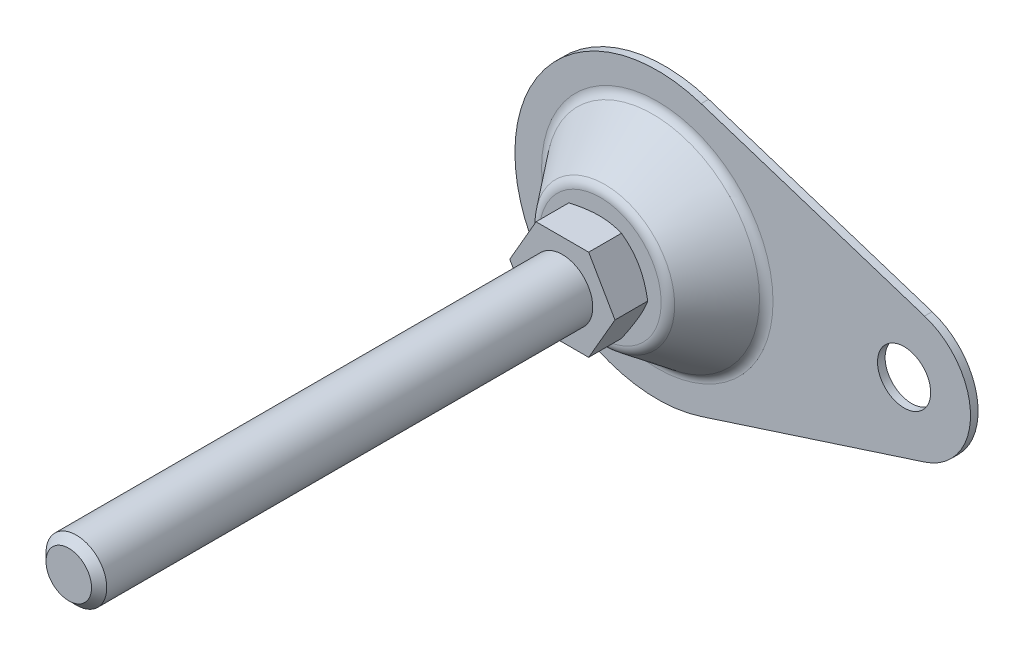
ISO-10303-21;
HEADER;
FILE_DESCRIPTION(('STEP AP214'),'2;1');
FILE_NAME('part.step','',(''),(''),'','','');
FILE_SCHEMA(('AUTOMOTIVE_DESIGN { 1 0 10303 214 1 1 1 1 }'));
ENDSEC;
DATA;
#1=APPLICATION_CONTEXT('core data for automotive mechanical design processes');
#2=APPLICATION_PROTOCOL_DEFINITION('international standard','automotive_design',2000,#1);
#3=PRODUCT_CONTEXT('',#1,'mechanical');
#4=PRODUCT('Part','Part','',(#3));
#5=PRODUCT_RELATED_PRODUCT_CATEGORY('part','',(#4));
#6=PRODUCT_DEFINITION_FORMATION('','',#4);
#7=PRODUCT_DEFINITION_CONTEXT('part definition',#1,'design');
#8=PRODUCT_DEFINITION('design','',#6,#7);
#9=PRODUCT_DEFINITION_SHAPE('','',#8);
#10=(LENGTH_UNIT() NAMED_UNIT(*) SI_UNIT(.MILLI.,.METRE.));
#11=(NAMED_UNIT(*) PLANE_ANGLE_UNIT() SI_UNIT($,.RADIAN.));
#12=(NAMED_UNIT(*) SI_UNIT($,.STERADIAN.) SOLID_ANGLE_UNIT());
#13=UNCERTAINTY_MEASURE_WITH_UNIT(LENGTH_MEASURE(1.E-05),#10,'distance_accuracy_value','');
#14=(GEOMETRIC_REPRESENTATION_CONTEXT(3) GLOBAL_UNCERTAINTY_ASSIGNED_CONTEXT((#13)) GLOBAL_UNIT_ASSIGNED_CONTEXT((#10,
#11,#12)) REPRESENTATION_CONTEXT('',''));
#15=CARTESIAN_POINT('',(0.,0.,0.));
#16=DIRECTION('',(0.,0.,1.));
#17=DIRECTION('',(1.,0.,0.));
#18=AXIS2_PLACEMENT_3D('',#15,#16,#17);
#19=CARTESIAN_POINT('',(65.,0.,2.));
#20=DIRECTION('',(0.,0.,1.));
#21=DIRECTION('',(1.,0.,0.));
#22=AXIS2_PLACEMENT_3D('',#19,#20,#21);
#23=PLANE('',#22);
#24=CARTESIAN_POINT('',(0.,0.,2.));
#25=DIRECTION('',(0.,0.,1.));
#26=DIRECTION('',(1.,0.,0.));
#27=AXIS2_PLACEMENT_3D('',#24,#25,#26);
#28=CIRCLE('',#27,30.4802116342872);
#29=CARTESIAN_POINT('',(30.4802116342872,0.,2.));
#30=VERTEX_POINT('',#29);
#31=EDGE_CURVE('E245',#30,#30,#28,.F.);
#32=ORIENTED_EDGE('',*,*,#31,.T.);
#33=EDGE_LOOP('',(#32));
#34=FACE_BOUND('',#33,.T.);
#35=CARTESIAN_POINT('',(65.,0.,2.));
#36=DIRECTION('',(0.,0.,1.));
#37=DIRECTION('',(1.,0.,0.));
#38=AXIS2_PLACEMENT_3D('',#35,#36,#37);
#39=CIRCLE('',#38,7.);
#40=CARTESIAN_POINT('',(72.,0.,2.));
#41=VERTEX_POINT('',#40);
#42=EDGE_CURVE('E262',#41,#41,#39,.T.);
#43=ORIENTED_EDGE('',*,*,#42,.F.);
#44=EDGE_LOOP('',(#43));
#45=FACE_BOUND('',#44,.T.);
#46=DIRECTION('',(-0.951485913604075,0.307692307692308,0.));
#47=VECTOR('',#46,1.);
#48=CARTESIAN_POINT('',(11.5384615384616,35.6807217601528,2.));
#49=LINE('',#48,#47);
#50=CARTESIAN_POINT('',(70.3846153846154,16.6510034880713,2.));
#51=VERTEX_POINT('',#50);
#52=CARTESIAN_POINT('',(11.5384615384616,35.6807217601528,2.));
#53=VERTEX_POINT('',#52);
#54=EDGE_CURVE('E112',#51,#53,#49,.T.);
#55=ORIENTED_EDGE('',*,*,#54,.T.);
#56=CARTESIAN_POINT('',(0.,0.,2.));
#57=DIRECTION('',(0.,0.,1.));
#58=DIRECTION('',(1.,0.,0.));
#59=AXIS2_PLACEMENT_3D('',#56,#57,#58);
#60=CIRCLE('',#59,37.5);
#61=CARTESIAN_POINT('',(11.5384615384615,-35.6807217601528,2.));
#62=VERTEX_POINT('',#61);
#63=EDGE_CURVE('E114',#53,#62,#60,.T.);
#64=ORIENTED_EDGE('',*,*,#63,.T.);
#65=DIRECTION('',(0.951485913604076,0.307692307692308,0.));
#66=VECTOR('',#65,1.);
#67=CARTESIAN_POINT('',(11.5384615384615,-35.6807217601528,2.));
#68=LINE('',#67,#66);
#69=CARTESIAN_POINT('',(70.3846153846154,-16.6510034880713,2.));
#70=VERTEX_POINT('',#69);
#71=EDGE_CURVE('E97',#62,#70,#68,.T.);
#72=ORIENTED_EDGE('',*,*,#71,.T.);
#73=CARTESIAN_POINT('',(65.,0.,2.));
#74=DIRECTION('',(0.,0.,1.));
#75=DIRECTION('',(1.,0.,0.));
#76=AXIS2_PLACEMENT_3D('',#73,#74,#75);
#77=CIRCLE('',#76,17.5);
#78=EDGE_CURVE('E106',#70,#51,#77,.T.);
#79=ORIENTED_EDGE('',*,*,#78,.T.);
#80=EDGE_LOOP('',(#55,#64,#72,#79));
#81=FACE_BOUND('',#80,.T.);
#82=ADVANCED_FACE('F14',(#34,#45,#81),#23,.T.);
#83=CARTESIAN_POINT('',(65.,0.,0.));
#84=DIRECTION('',(0.,0.,1.));
#85=DIRECTION('',(1.,0.,0.));
#86=AXIS2_PLACEMENT_3D('',#83,#84,#85);
#87=PLANE('',#86);
#88=CARTESIAN_POINT('',(65.,0.,0.));
#89=DIRECTION('',(0.,0.,1.));
#90=DIRECTION('',(1.,0.,0.));
#91=AXIS2_PLACEMENT_3D('',#88,#89,#90);
#92=CIRCLE('',#91,7.);
#93=CARTESIAN_POINT('',(72.,0.,0.));
#94=VERTEX_POINT('',#93);
#95=EDGE_CURVE('E258',#94,#94,#92,.T.);
#96=ORIENTED_EDGE('',*,*,#95,.T.);
#97=EDGE_LOOP('',(#96));
#98=FACE_BOUND('',#97,.T.);
#99=CARTESIAN_POINT('',(0.,0.,0.));
#100=DIRECTION('',(0.,0.,1.));
#101=DIRECTION('',(1.,0.,0.));
#102=AXIS2_PLACEMENT_3D('',#99,#100,#101);
#103=CIRCLE('',#102,37.5);
#104=CARTESIAN_POINT('',(11.5384615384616,35.6807217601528,0.));
#105=VERTEX_POINT('',#104);
#106=CARTESIAN_POINT('',(11.5384615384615,-35.6807217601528,0.));
#107=VERTEX_POINT('',#106);
#108=EDGE_CURVE('E275',#105,#107,#103,.T.);
#109=ORIENTED_EDGE('',*,*,#108,.F.);
#110=DIRECTION('',(-0.951485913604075,0.307692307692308,0.));
#111=VECTOR('',#110,1.);
#112=CARTESIAN_POINT('',(70.3846153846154,16.6510034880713,0.));
#113=LINE('',#112,#111);
#114=CARTESIAN_POINT('',(70.3846153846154,16.6510034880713,0.));
#115=VERTEX_POINT('',#114);
#116=EDGE_CURVE('E9',#115,#105,#113,.T.);
#117=ORIENTED_EDGE('',*,*,#116,.F.);
#118=CARTESIAN_POINT('',(65.,0.,0.));
#119=DIRECTION('',(0.,0.,1.));
#120=DIRECTION('',(1.,0.,0.));
#121=AXIS2_PLACEMENT_3D('',#118,#119,#120);
#122=CIRCLE('',#121,17.5);
#123=CARTESIAN_POINT('',(70.3846153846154,-16.6510034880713,0.));
#124=VERTEX_POINT('',#123);
#125=EDGE_CURVE('E22',#124,#115,#122,.T.);
#126=ORIENTED_EDGE('',*,*,#125,.F.);
#127=DIRECTION('',(0.951485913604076,0.307692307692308,0.));
#128=VECTOR('',#127,1.);
#129=CARTESIAN_POINT('',(70.3846153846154,-16.6510034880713,0.));
#130=LINE('',#129,#128);
#131=EDGE_CURVE('E99',#107,#124,#130,.T.);
#132=ORIENTED_EDGE('',*,*,#131,.F.);
#133=EDGE_LOOP('',(#109,#117,#126,#132));
#134=FACE_BOUND('',#133,.T.);
#135=ADVANCED_FACE('F215',(#98,#134),#87,.F.);
#136=CARTESIAN_POINT('',(0.,0.,17.));
#137=DIRECTION('',(0.,0.,-1.));
#138=DIRECTION('',(-1.,0.,0.));
#139=AXIS2_PLACEMENT_3D('',#136,#137,#138);
#140=PLANE('',#139);
#141=CARTESIAN_POINT('',(0.,0.,17.));
#142=DIRECTION('',(0.,0.,-1.));
#143=DIRECTION('',(-1.,0.,0.));
#144=AXIS2_PLACEMENT_3D('',#141,#142,#143);
#145=CIRCLE('',#144,16.0197883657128);
#146=CARTESIAN_POINT('',(-16.0197883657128,0.,17.));
#147=VERTEX_POINT('',#146);
#148=EDGE_CURVE('E278',#147,#147,#145,.F.);
#149=ORIENTED_EDGE('',*,*,#148,.T.);
#150=EDGE_LOOP('',(#149));
#151=FACE_BOUND('',#150,.T.);
#152=CARTESIAN_POINT('',(0.,0.,17.));
#153=DIRECTION('',(0.,0.,-1.));
#154=DIRECTION('',(-1.,0.,0.));
#155=AXIS2_PLACEMENT_3D('',#152,#153,#154);
#156=CIRCLE('',#155,11.5);
#157=CARTESIAN_POINT('',(-11.5,0.,17.));
#158=VERTEX_POINT('',#157);
#159=EDGE_CURVE('E122',#158,#158,#156,.T.);
#160=ORIENTED_EDGE('',*,*,#159,.T.);
#161=EDGE_LOOP('',(#160));
#162=FACE_BOUND('',#161,.T.);
#163=ADVANCED_FACE('F211',(#151,#162),#140,.F.);
#164=CARTESIAN_POINT('',(0.,0.,5.));
#165=DIRECTION('',(0.,0.,1.));
#166=DIRECTION('',(1.,0.,0.));
#167=AXIS2_PLACEMENT_3D('',#164,#165,#166);
#168=TOROIDAL_SURFACE('',#167,30.4802116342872,3.);
#169=CARTESIAN_POINT('',(0.,0.,3.1747053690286));
#170=DIRECTION('',(0.,0.,1.));
#171=DIRECTION('',(1.,0.,0.));
#172=AXIS2_PLACEMENT_3D('',#169,#170,#171);
#173=CIRCLE('',#172,28.0993925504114);
#174=CARTESIAN_POINT('',(28.0993925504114,0.,3.1747053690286));
#175=VERTEX_POINT('',#174);
#176=EDGE_CURVE('E242',#175,#175,#173,.T.);
#177=ORIENTED_EDGE('',*,*,#176,.F.);
#178=EDGE_LOOP('',(#177));
#179=FACE_BOUND('',#178,.T.);
#180=ORIENTED_EDGE('',*,*,#31,.F.);
#181=EDGE_LOOP('',(#180));
#182=FACE_BOUND('',#181,.T.);
#183=ADVANCED_FACE('F214',(#179,#182),#168,.F.);
#184=CARTESIAN_POINT('',(0.,0.,14.));
#185=DIRECTION('',(0.,0.,-1.));
#186=DIRECTION('',(-1.,0.,0.));
#187=AXIS2_PLACEMENT_3D('',#184,#185,#186);
#188=TOROIDAL_SURFACE('',#187,16.0197883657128,3.);
#189=ORIENTED_EDGE('',*,*,#148,.F.);
#190=EDGE_LOOP('',(#189));
#191=FACE_BOUND('',#190,.T.);
#192=CARTESIAN_POINT('',(0.,0.,15.8252946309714));
#193=DIRECTION('',(0.,0.,1.));
#194=DIRECTION('',(1.,0.,0.));
#195=AXIS2_PLACEMENT_3D('',#192,#193,#194);
#196=CIRCLE('',#195,18.4006074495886);
#197=CARTESIAN_POINT('',(18.4006074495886,0.,15.8252946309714));
#198=VERTEX_POINT('',#197);
#199=EDGE_CURVE('E251',#198,#198,#196,.F.);
#200=ORIENTED_EDGE('',*,*,#199,.F.);
#201=EDGE_LOOP('',(#200));
#202=FACE_BOUND('',#201,.T.);
#203=ADVANCED_FACE('F229',(#191,#202),#188,.T.);
#204=CARTESIAN_POINT('',(0.,0.,2.));
#205=DIRECTION('',(0.,0.,-1.));
#206=DIRECTION('',(-1.,0.,0.));
#207=AXIS2_PLACEMENT_3D('',#204,#205,#206);
#208=CYLINDRICAL_SURFACE('',#207,37.5);
#209=ORIENTED_EDGE('',*,*,#108,.T.);
#210=DIRECTION('',(0.,0.,1.));
#211=VECTOR('',#210,1.);
#212=CARTESIAN_POINT('',(11.5384615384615,-35.6807217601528,-8.));
#213=LINE('',#212,#211);
#214=EDGE_CURVE('E103',#107,#62,#213,.T.);
#215=ORIENTED_EDGE('',*,*,#214,.T.);
#216=ORIENTED_EDGE('',*,*,#63,.F.);
#217=DIRECTION('',(0.,0.,1.));
#218=VECTOR('',#217,1.);
#219=CARTESIAN_POINT('',(11.5384615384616,35.6807217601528,-8.));
#220=LINE('',#219,#218);
#221=EDGE_CURVE('E119',#105,#53,#220,.T.);
#222=ORIENTED_EDGE('',*,*,#221,.F.);
#223=EDGE_LOOP('',(#209,#215,#216,#222));
#224=FACE_BOUND('',#223,.T.);
#225=ADVANCED_FACE('F219',(#224),#208,.T.);
#226=CARTESIAN_POINT('',(65.,0.,2.));
#227=DIRECTION('',(0.,0.,-1.));
#228=DIRECTION('',(-1.,0.,0.));
#229=AXIS2_PLACEMENT_3D('',#226,#227,#228);
#230=CYLINDRICAL_SURFACE('',#229,7.);
#231=ORIENTED_EDGE('',*,*,#42,.T.);
#232=EDGE_LOOP('',(#231));
#233=FACE_BOUND('',#232,.T.);
#234=ORIENTED_EDGE('',*,*,#95,.F.);
#235=EDGE_LOOP('',(#234));
#236=FACE_BOUND('',#235,.T.);
#237=ADVANCED_FACE('F209',(#233,#236),#230,.F.);
#238=CARTESIAN_POINT('',(0.,0.,2.));
#239=DIRECTION('',(0.,0.,-1.));
#240=DIRECTION('',(-1.,0.,0.));
#241=AXIS2_PLACEMENT_3D('',#238,#239,#240);
#242=CONICAL_SURFACE('',#241,29.,0.654082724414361);
#243=ORIENTED_EDGE('',*,*,#176,.T.);
#244=EDGE_LOOP('',(#243));
#245=FACE_BOUND('',#244,.T.);
#246=ORIENTED_EDGE('',*,*,#199,.T.);
#247=EDGE_LOOP('',(#246));
#248=FACE_BOUND('',#247,.T.);
#249=ADVANCED_FACE('F151',(#245,#248),#242,.T.);
#250=CARTESIAN_POINT('',(0.,0.,17.));
#251=DIRECTION('',(0.,0.,1.));
#252=DIRECTION('',(1.,0.,0.));
#253=AXIS2_PLACEMENT_3D('',#250,#251,#252);
#254=CONICAL_SURFACE('',#253,11.5,1.0471975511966);
#255=ORIENTED_EDGE('',*,*,#159,.F.);
#256=EDGE_LOOP('',(#255));
#257=FACE_BOUND('',#256,.T.);
#258=CARTESIAN_POINT('',(13.8565219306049,0.000200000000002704,18.3605385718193));
#259=CARTESIAN_POINT('',(13.7042251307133,-0.263585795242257,18.2726247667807));
#260=CARTESIAN_POINT('',(13.5513604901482,-0.528355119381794,18.1887011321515));
#261=CARTESIAN_POINT('',(13.244405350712,-1.06001701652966,18.0299413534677));
#262=CARTESIAN_POINT('',(13.0903144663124,-1.32691025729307,17.9551081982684));
#263=CARTESIAN_POINT('',(12.6255589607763,-2.131890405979,17.745692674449));
#264=CARTESIAN_POINT('',(12.3130596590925,-2.6731550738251,17.6265783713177));
#265=CARTESIAN_POINT('',(11.8454187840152,-3.48313282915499,17.486906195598));
#266=CARTESIAN_POINT('',(11.6916742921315,-3.74942610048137,17.4471189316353));
#267=CARTESIAN_POINT('',(11.3834734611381,-4.28324559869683,17.3803985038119));
#268=CARTESIAN_POINT('',(11.2290171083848,-4.55077184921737,17.3534655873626));
#269=CARTESIAN_POINT('',(10.9198468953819,-5.08627036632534,17.3131437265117));
#270=CARTESIAN_POINT('',(10.7651335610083,-5.35424172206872,17.2997386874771));
#271=CARTESIAN_POINT('',(10.4555635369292,-5.89043273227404,17.286758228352));
#272=CARTESIAN_POINT('',(10.3007068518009,-6.15865237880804,17.2871823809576));
#273=CARTESIAN_POINT('',(10.0112020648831,-6.66008937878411,17.3008951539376));
#274=CARTESIAN_POINT('',(9.87653331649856,-6.89334249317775,17.3125111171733));
#275=CARTESIAN_POINT('',(9.60750555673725,-7.35931224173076,17.3459831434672));
#276=CARTESIAN_POINT('',(9.47314656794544,-7.59202883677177,17.367839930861));
#277=CARTESIAN_POINT('',(9.2048113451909,-8.05679907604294,17.4214125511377));
#278=CARTESIAN_POINT('',(9.07083551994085,-8.288852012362,17.4531365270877));
#279=CARTESIAN_POINT('',(8.80351197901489,-8.75186996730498,17.5258869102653));
#280=CARTESIAN_POINT('',(8.67016430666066,-8.98283491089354,17.566913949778));
#281=CARTESIAN_POINT('',(8.2653799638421,-9.68394195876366,17.7049867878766));
#282=CARTESIAN_POINT('',(7.99511549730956,-10.1520537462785,17.8158000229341));
#283=CARTESIAN_POINT('',(7.45861659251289,-11.0812971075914,18.0673009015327));
#284=CARTESIAN_POINT('',(7.19237528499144,-11.5424405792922,18.2079294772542));
#285=CARTESIAN_POINT('',(6.92808776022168,-12.0002,18.3605385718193));
#286=B_SPLINE_CURVE_WITH_KNOTS('',3,(#258,#259,#260,#261,#262,#263,#264,#265,#266,#267,#268,
#269,#270,#271,#272,#273,#274,#275,#276,#277,#278,#279,#280,#281,#282,#283,#284,#285),
.UNSPECIFIED.,.F.,.F.,(4,2,2,2,2,2,2,2,2,2,2,2,2,4),(0.,0.951004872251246,1.90232158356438,
3.80900466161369,4.7389455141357,5.66890426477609,6.59775529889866,7.52657763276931,
8.33514643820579,9.1437724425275,9.95306755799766,10.7624176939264,12.4167102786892,
14.0677556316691),.UNSPECIFIED.);
#287=CARTESIAN_POINT('',(13.856406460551,0.,18.3604719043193));
#288=VERTEX_POINT('',#287);
#289=CARTESIAN_POINT('',(6.92820323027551,-12.,18.3604719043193));
#290=VERTEX_POINT('',#289);
#291=EDGE_CURVE('E29',#288,#290,#286,.T.);
#292=ORIENTED_EDGE('',*,*,#291,.T.);
#293=CARTESIAN_POINT('',(-18.6034808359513,-12.,23.1418320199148));
#294=CARTESIAN_POINT('',(-18.3414128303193,-12.,23.0146864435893));
#295=CARTESIAN_POINT('',(-18.0790370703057,-12.,22.8881755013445));
#296=CARTESIAN_POINT('',(-17.5536058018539,-12.,22.6365666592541));
#297=CARTESIAN_POINT('',(-17.2905502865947,-12.,22.5114687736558));
#298=CARTESIAN_POINT('',(-16.5001975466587,-12.,22.1384773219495));
#299=CARTESIAN_POINT('',(-15.9717918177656,-12.,21.8929237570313));
#300=CARTESIAN_POINT('',(-14.9085634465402,-12.,21.4082203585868));
#301=CARTESIAN_POINT('',(-14.373721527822,-12.,21.1691127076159));
#302=CARTESIAN_POINT('',(-13.2997809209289,-12.,20.7006903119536));
#303=CARTESIAN_POINT('',(-12.7606824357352,-12.,20.4713751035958));
#304=CARTESIAN_POINT('',(-11.6601840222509,-12.,20.0180500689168));
#305=CARTESIAN_POINT('',(-11.0986189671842,-12.,19.7944390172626));
#306=CARTESIAN_POINT('',(-9.96891314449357,-12.,19.3641556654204));
#307=CARTESIAN_POINT('',(-9.40077164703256,-12.,19.1574852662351));
#308=CARTESIAN_POINT('',(-8.25809219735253,-12.,18.7665151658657));
#309=CARTESIAN_POINT('',(-7.68356986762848,-12.,18.5821701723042));
#310=CARTESIAN_POINT('',(-6.52623074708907,-12.,18.2417592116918));
#311=CARTESIAN_POINT('',(-5.94341663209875,-12.,18.0856843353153));
#312=CARTESIAN_POINT('',(-5.06443695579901,-12.,17.8788385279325));
#313=CARTESIAN_POINT('',(-4.77142883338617,-12.,17.8145681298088));
#314=CARTESIAN_POINT('',(-4.18341169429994,-12.,17.6958896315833));
#315=CARTESIAN_POINT('',(-3.88840271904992,-12.,17.6414813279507));
#316=CARTESIAN_POINT('',(-3.29658866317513,-12.,17.5434879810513));
#317=CARTESIAN_POINT('',(-2.99978361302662,-12.,17.4999027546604));
#318=CARTESIAN_POINT('',(-2.40469164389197,-12.,17.4244250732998));
#319=CARTESIAN_POINT('',(-2.10640478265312,-12.,17.3925321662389));
#320=CARTESIAN_POINT('',(-1.51266053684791,-12.,17.3414724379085));
#321=CARTESIAN_POINT('',(-1.21721705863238,-12.,17.3221448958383));
#322=CARTESIAN_POINT('',(-0.625778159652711,-12.,17.2960004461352));
#323=CARTESIAN_POINT('',(-0.329782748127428,-12.,17.2891833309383));
#324=CARTESIAN_POINT('',(0.26223462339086,-12.,17.288221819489));
#325=CARTESIAN_POINT('',(0.558256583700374,-12.,17.2940776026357));
#326=CARTESIAN_POINT('',(1.14979047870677,-12.,17.3183195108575));
#327=CARTESIAN_POINT('',(1.44530238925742,-12.,17.3367062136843));
#328=CARTESIAN_POINT('',(2.15554259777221,-12.,17.3955667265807));
#329=CARTESIAN_POINT('',(2.56978668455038,-12.,17.441987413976));
#330=CARTESIAN_POINT('',(3.39520007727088,-12.,17.5569238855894));
#331=CARTESIAN_POINT('',(3.80636895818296,-12.,17.6254426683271));
#332=CARTESIAN_POINT('',(4.62523340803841,-12.,17.7821381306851));
#333=CARTESIAN_POINT('',(5.03292608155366,-12.,17.8703297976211));
#334=CARTESIAN_POINT('',(5.84422287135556,-12.,18.0636826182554));
#335=CARTESIAN_POINT('',(6.24782704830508,-12.,18.1688435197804));
#336=CARTESIAN_POINT('',(7.0601465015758,-12.,18.3961537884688));
#337=CARTESIAN_POINT('',(7.46876788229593,-12.,18.518636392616));
#338=CARTESIAN_POINT('',(8.28198343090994,-12.,18.7762444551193));
#339=CARTESIAN_POINT('',(8.68657756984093,-12.,18.9113700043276));
#340=CARTESIAN_POINT('',(9.49194322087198,-12.,19.1921188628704));
#341=CARTESIAN_POINT('',(9.89271592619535,-12.,19.3377387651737));
#342=CARTESIAN_POINT('',(10.690936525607,-12.,19.6377638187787));
#343=CARTESIAN_POINT('',(11.0883844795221,-12.,19.7921688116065));
#344=CARTESIAN_POINT('',(12.1084987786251,-12.,20.1993733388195));
#345=CARTESIAN_POINT('',(12.7289932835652,-12.,20.457608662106));
#346=CARTESIAN_POINT('',(13.9640777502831,-12.,20.9878780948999));
#347=CARTESIAN_POINT('',(14.5786671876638,-12.,21.2599134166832));
#348=CARTESIAN_POINT('',(15.8032084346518,-12.,21.8146905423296));
#349=CARTESIAN_POINT('',(16.4131587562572,-12.,22.0974356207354));
#350=CARTESIAN_POINT('',(17.6291136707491,-12.,22.6712129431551));
#351=CARTESIAN_POINT('',(18.2351183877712,-12.,22.9622449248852));
#352=CARTESIAN_POINT('',(19.4447472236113,-12.,23.5512835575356));
#353=CARTESIAN_POINT('',(20.0483669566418,-12.,23.8492991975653));
#354=CARTESIAN_POINT('',(21.2529654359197,-12.,24.4506224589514));
#355=CARTESIAN_POINT('',(21.8539441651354,-12.,24.7539301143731));
#356=CARTESIAN_POINT('',(23.0536032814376,-12.,25.3647903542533));
#357=CARTESIAN_POINT('',(23.6522840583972,-12.,25.6723421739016));
#358=CARTESIAN_POINT('',(24.8478150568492,-12.,26.2909853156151));
#359=CARTESIAN_POINT('',(25.4446652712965,-12.,26.6020766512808));
#360=CARTESIAN_POINT('',(27.1170634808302,-12.,27.4789942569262));
#361=CARTESIAN_POINT('',(28.1908770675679,-12.,28.0481278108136));
#362=CARTESIAN_POINT('',(30.33482492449,-12.,29.1933937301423));
#363=CARTESIAN_POINT('',(31.4049590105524,-12.,29.769526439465));
#364=CARTESIAN_POINT('',(33.5392426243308,-12.,30.9253644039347));
#365=CARTESIAN_POINT('',(34.6034005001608,-12.,31.5050542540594));
#366=CARTESIAN_POINT('',(36.197939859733,-12.,32.3776038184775));
#367=CARTESIAN_POINT('',(36.7291526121,-12.,32.6689464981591));
#368=CARTESIAN_POINT('',(37.7910818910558,-12.,33.2525332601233));
#369=CARTESIAN_POINT('',(38.3217984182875,-12.,33.5447773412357));
#370=CARTESIAN_POINT('',(38.8522964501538,-12.,33.8374176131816));
#371=B_SPLINE_CURVE_WITH_KNOTS('',3,(#293,#294,#295,#296,#297,#298,#299,#300,#301,#302,#303,
#304,#305,#306,#307,#308,#309,#310,#311,#312,#313,#314,#315,#316,#317,#318,#319,#320,#321,#322,
#323,#324,#325,#326,#327,#328,#329,#330,#331,#332,#333,#334,#335,#336,#337,#338,#339,#340,#341,
#342,#343,#344,#345,#346,#347,#348,#349,#350,#351,#352,#353,#354,#355,#356,#357,#358,#359,#360,
#361,#362,#363,#364,#365,#366,#367,#368,#369,#370),.UNSPECIFIED.,.F.,.F.,(4,2,2,2,2,2,2,2,2,2,2,
2,2,2,2,2,2,2,2,2,2,2,2,2,2,2,2,2,2,2,2,2,2,2,2,2,2,2,4),(0.,0.873846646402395,1.74770209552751,
3.49567216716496,5.25316649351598,7.01057751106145,8.82371240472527,10.637050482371,
12.4466458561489,14.2556699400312,15.1554530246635,16.0552175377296,16.9549668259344,
17.8546813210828,18.7426487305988,19.6306014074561,20.5185666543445,21.4065728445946,
22.6563925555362,23.9063819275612,25.1573268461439,26.4082531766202,27.6877588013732,
28.9672736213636,30.2463748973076,31.5254531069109,33.5414669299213,35.5576581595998,
37.5744709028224,39.5912198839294,41.6107252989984,43.6302437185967,45.6494028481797,
47.6685697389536,51.3144724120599,54.9605549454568,58.5959589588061,60.4135413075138,
62.2311212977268),.UNSPECIFIED.);
#372=CARTESIAN_POINT('',(-6.92820323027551,-12.,18.3604719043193));
#373=VERTEX_POINT('',#372);
#374=EDGE_CURVE('E158',#290,#373,#371,.F.);
#375=ORIENTED_EDGE('',*,*,#374,.T.);
#376=CARTESIAN_POINT('',(-6.92808776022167,-12.0002,18.3605385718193));
#377=CARTESIAN_POINT('',(-7.08038456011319,-11.7364142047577,18.2726247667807));
#378=CARTESIAN_POINT('',(-7.23324920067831,-11.4716448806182,18.1887011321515));
#379=CARTESIAN_POINT('',(-7.5402043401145,-10.9399829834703,18.0299413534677));
#380=CARTESIAN_POINT('',(-7.69429522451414,-10.6730897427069,17.9551081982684));
#381=CARTESIAN_POINT('',(-8.15905073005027,-9.868109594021,17.745692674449));
#382=CARTESIAN_POINT('',(-8.47155003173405,-9.32684492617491,17.6265783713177));
#383=CARTESIAN_POINT('',(-8.93919090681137,-8.51686717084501,17.486906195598));
#384=CARTESIAN_POINT('',(-9.09293539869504,-8.25057389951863,17.4471189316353));
#385=CARTESIAN_POINT('',(-9.40113622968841,-7.71675440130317,17.3803985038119));
#386=CARTESIAN_POINT('',(-9.55559258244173,-7.44922815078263,17.3534655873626));
#387=CARTESIAN_POINT('',(-9.86476279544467,-6.91372963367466,17.3131437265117));
#388=CARTESIAN_POINT('',(-10.0194761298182,-6.64575827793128,17.2997386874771));
#389=CARTESIAN_POINT('',(-10.3290461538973,-6.10956726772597,17.286758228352));
#390=CARTESIAN_POINT('',(-10.4839028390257,-5.84134762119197,17.2871823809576));
#391=CARTESIAN_POINT('',(-10.7734076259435,-5.3399106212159,17.3008951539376));
#392=CARTESIAN_POINT('',(-10.908076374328,-5.10665750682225,17.3125111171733));
#393=CARTESIAN_POINT('',(-11.1771041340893,-4.64068775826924,17.3459831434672));
#394=CARTESIAN_POINT('',(-11.3114631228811,-4.40797116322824,17.367839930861));
#395=CARTESIAN_POINT('',(-11.5797983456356,-3.94320092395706,17.4214125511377));
#396=CARTESIAN_POINT('',(-11.7137741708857,-3.711147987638,17.4531365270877));
#397=CARTESIAN_POINT('',(-11.9810977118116,-3.24813003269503,17.5258869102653));
#398=CARTESIAN_POINT('',(-12.1144453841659,-3.01716508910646,17.566913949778));
#399=CARTESIAN_POINT('',(-12.5192297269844,-2.31605804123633,17.7049867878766));
#400=CARTESIAN_POINT('',(-12.789494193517,-1.84794625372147,17.8158000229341));
#401=CARTESIAN_POINT('',(-13.3259930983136,-0.918702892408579,18.0673009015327));
#402=CARTESIAN_POINT('',(-13.5922344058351,-0.457559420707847,18.2079294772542));
#403=CARTESIAN_POINT('',(-13.8565219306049,0.000199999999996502,18.3605385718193));
#404=B_SPLINE_CURVE_WITH_KNOTS('',3,(#376,#377,#378,#379,#380,#381,#382,#383,#384,#385,#386,
#387,#388,#389,#390,#391,#392,#393,#394,#395,#396,#397,#398,#399,#400,#401,#402,#403),
.UNSPECIFIED.,.F.,.F.,(4,2,2,2,2,2,2,2,2,2,2,2,2,4),(0.,0.951004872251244,1.90232158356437,
3.80900466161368,4.7389455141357,5.66890426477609,6.59775529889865,7.5265776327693,
8.33514643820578,9.14377244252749,9.95306755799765,10.7624176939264,12.4167102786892,
14.0677556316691),.UNSPECIFIED.);
#405=CARTESIAN_POINT('',(-13.856406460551,0.,18.3604719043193));
#406=VERTEX_POINT('',#405);
#407=EDGE_CURVE('E127',#373,#406,#404,.T.);
#408=ORIENTED_EDGE('',*,*,#407,.T.);
#409=CARTESIAN_POINT('',(-13.8565219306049,-0.000200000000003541,18.3605385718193));
#410=CARTESIAN_POINT('',(-13.7042251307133,0.26358579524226,18.2726247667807));
#411=CARTESIAN_POINT('',(-13.5513604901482,0.528355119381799,18.1887011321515));
#412=CARTESIAN_POINT('',(-13.244405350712,1.06001701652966,18.0299413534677));
#413=CARTESIAN_POINT('',(-13.0903144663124,1.32691025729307,17.9551081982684));
#414=CARTESIAN_POINT('',(-12.6255589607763,2.13189040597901,17.745692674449));
#415=CARTESIAN_POINT('',(-12.3130596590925,2.6731550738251,17.6265783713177));
#416=CARTESIAN_POINT('',(-11.8454187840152,3.483132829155,17.486906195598));
#417=CARTESIAN_POINT('',(-11.6916742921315,3.74942610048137,17.4471189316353));
#418=CARTESIAN_POINT('',(-11.3834734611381,4.28324559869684,17.3803985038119));
#419=CARTESIAN_POINT('',(-11.2290171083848,4.55077184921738,17.3534655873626));
#420=CARTESIAN_POINT('',(-10.9198468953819,5.08627036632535,17.3131437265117));
#421=CARTESIAN_POINT('',(-10.7651335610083,5.35424172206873,17.2997386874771));
#422=CARTESIAN_POINT('',(-10.4555635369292,5.89043273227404,17.286758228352));
#423=CARTESIAN_POINT('',(-10.3007068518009,6.15865237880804,17.2871823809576));
#424=CARTESIAN_POINT('',(-10.0112020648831,6.66008937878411,17.3008951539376));
#425=CARTESIAN_POINT('',(-9.87653331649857,6.89334249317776,17.3125111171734));
#426=CARTESIAN_POINT('',(-9.60750555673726,7.35931224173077,17.3459831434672));
#427=CARTESIAN_POINT('',(-9.47314656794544,7.59202883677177,17.367839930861));
#428=CARTESIAN_POINT('',(-9.20481134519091,8.05679907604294,17.4214125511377));
#429=CARTESIAN_POINT('',(-9.07083551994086,8.288852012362,17.4531365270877));
#430=CARTESIAN_POINT('',(-8.8035119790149,8.75186996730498,17.5258869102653));
#431=CARTESIAN_POINT('',(-8.67016430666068,8.98283491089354,17.566913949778));
#432=CARTESIAN_POINT('',(-8.26537996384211,9.68394195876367,17.7049867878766));
#433=CARTESIAN_POINT('',(-7.99511549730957,10.1520537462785,17.8158000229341));
#434=CARTESIAN_POINT('',(-7.4586165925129,11.0812971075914,18.0673009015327));
#435=CARTESIAN_POINT('',(-7.19237528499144,11.5424405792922,18.2079294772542));
#436=CARTESIAN_POINT('',(-6.92808776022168,12.0002,18.3605385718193));
#437=B_SPLINE_CURVE_WITH_KNOTS('',3,(#409,#410,#411,#412,#413,#414,#415,#416,#417,#418,#419,
#420,#421,#422,#423,#424,#425,#426,#427,#428,#429,#430,#431,#432,#433,#434,#435,#436),
.UNSPECIFIED.,.F.,.F.,(4,2,2,2,2,2,2,2,2,2,2,2,2,4),(0.,0.951004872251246,1.90232158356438,
3.80900466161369,4.7389455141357,5.66890426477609,6.59775529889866,7.52657763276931,
8.33514643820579,9.14377244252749,9.95306755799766,10.7624176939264,12.4167102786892,
14.0677556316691),.UNSPECIFIED.);
#438=CARTESIAN_POINT('',(-6.92820323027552,12.,18.3604719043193));
#439=VERTEX_POINT('',#438);
#440=EDGE_CURVE('E135',#406,#439,#437,.T.);
#441=ORIENTED_EDGE('',*,*,#440,.T.);
#442=CARTESIAN_POINT('',(-18.6034808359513,12.,23.1418320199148));
#443=CARTESIAN_POINT('',(-18.3414128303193,12.,23.0146864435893));
#444=CARTESIAN_POINT('',(-18.0790370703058,12.,22.8881755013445));
#445=CARTESIAN_POINT('',(-17.5536058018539,12.,22.6365666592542));
#446=CARTESIAN_POINT('',(-17.2905502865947,12.,22.5114687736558));
#447=CARTESIAN_POINT('',(-16.5001975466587,12.,22.1384773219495));
#448=CARTESIAN_POINT('',(-15.9717918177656,12.,21.8929237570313));
#449=CARTESIAN_POINT('',(-14.9085634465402,12.,21.4082203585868));
#450=CARTESIAN_POINT('',(-14.373721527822,12.,21.1691127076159));
#451=CARTESIAN_POINT('',(-13.2997809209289,12.,20.7006903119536));
#452=CARTESIAN_POINT('',(-12.7606824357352,12.,20.4713751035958));
#453=CARTESIAN_POINT('',(-11.6601840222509,12.,20.0180500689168));
#454=CARTESIAN_POINT('',(-11.0986189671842,12.,19.7944390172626));
#455=CARTESIAN_POINT('',(-9.96891314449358,12.,19.3641556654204));
#456=CARTESIAN_POINT('',(-9.40077164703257,12.,19.1574852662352));
#457=CARTESIAN_POINT('',(-8.25809219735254,12.,18.7665151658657));
#458=CARTESIAN_POINT('',(-7.68356986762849,12.,18.5821701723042));
#459=CARTESIAN_POINT('',(-6.52623074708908,12.,18.2417592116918));
#460=CARTESIAN_POINT('',(-5.94341663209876,12.,18.0856843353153));
#461=CARTESIAN_POINT('',(-5.06443695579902,12.,17.8788385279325));
#462=CARTESIAN_POINT('',(-4.77142883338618,12.,17.8145681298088));
#463=CARTESIAN_POINT('',(-4.18341169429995,12.,17.6958896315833));
#464=CARTESIAN_POINT('',(-3.88840271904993,12.,17.6414813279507));
#465=CARTESIAN_POINT('',(-3.29658866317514,12.,17.5434879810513));
#466=CARTESIAN_POINT('',(-2.99978361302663,12.,17.4999027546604));
#467=CARTESIAN_POINT('',(-2.40469164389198,12.,17.4244250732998));
#468=CARTESIAN_POINT('',(-2.10640478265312,12.,17.3925321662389));
#469=CARTESIAN_POINT('',(-1.51266053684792,12.,17.3414724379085));
#470=CARTESIAN_POINT('',(-1.21721705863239,12.,17.3221448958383));
#471=CARTESIAN_POINT('',(-0.625778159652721,12.,17.2960004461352));
#472=CARTESIAN_POINT('',(-0.329782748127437,12.,17.2891833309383));
#473=CARTESIAN_POINT('',(0.262234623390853,12.,17.288221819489));
#474=CARTESIAN_POINT('',(0.558256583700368,12.,17.2940776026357));
#475=CARTESIAN_POINT('',(1.14979047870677,12.,17.3183195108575));
#476=CARTESIAN_POINT('',(1.44530238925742,12.,17.3367062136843));
#477=CARTESIAN_POINT('',(2.15554259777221,12.,17.3955667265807));
#478=CARTESIAN_POINT('',(2.56978668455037,12.,17.441987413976));
#479=CARTESIAN_POINT('',(3.39520007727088,12.,17.5569238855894));
#480=CARTESIAN_POINT('',(3.80636895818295,12.,17.6254426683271));
#481=CARTESIAN_POINT('',(4.6252334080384,12.,17.7821381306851));
#482=CARTESIAN_POINT('',(5.03292608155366,12.,17.8703297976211));
#483=CARTESIAN_POINT('',(5.84422287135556,12.,18.0636826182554));
#484=CARTESIAN_POINT('',(6.24782704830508,12.,18.1688435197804));
#485=CARTESIAN_POINT('',(7.0601465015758,12.,18.3961537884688));
#486=CARTESIAN_POINT('',(7.46876788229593,12.,18.518636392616));
#487=CARTESIAN_POINT('',(8.28198343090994,12.,18.7762444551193));
#488=CARTESIAN_POINT('',(8.68657756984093,12.,18.9113700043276));
#489=CARTESIAN_POINT('',(9.49194322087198,12.,19.1921188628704));
#490=CARTESIAN_POINT('',(9.89271592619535,12.,19.3377387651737));
#491=CARTESIAN_POINT('',(10.690936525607,12.,19.6377638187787));
#492=CARTESIAN_POINT('',(11.0883844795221,12.,19.7921688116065));
#493=CARTESIAN_POINT('',(12.1084987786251,12.,20.1993733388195));
#494=CARTESIAN_POINT('',(12.7289932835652,12.,20.457608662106));
#495=CARTESIAN_POINT('',(13.9640777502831,12.,20.9878780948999));
#496=CARTESIAN_POINT('',(14.5786671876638,12.,21.2599134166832));
#497=CARTESIAN_POINT('',(15.8032084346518,12.,21.8146905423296));
#498=CARTESIAN_POINT('',(16.4131587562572,12.,22.0974356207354));
#499=CARTESIAN_POINT('',(17.6291136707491,12.,22.6712129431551));
#500=CARTESIAN_POINT('',(18.2351183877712,12.,22.9622449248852));
#501=CARTESIAN_POINT('',(19.4447472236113,12.,23.5512835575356));
#502=CARTESIAN_POINT('',(20.0483669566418,12.,23.8492991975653));
#503=CARTESIAN_POINT('',(21.2529654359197,12.,24.4506224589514));
#504=CARTESIAN_POINT('',(21.8539441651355,12.,24.7539301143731));
#505=CARTESIAN_POINT('',(23.0536032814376,12.,25.3647903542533));
#506=CARTESIAN_POINT('',(23.6522840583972,12.,25.6723421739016));
#507=CARTESIAN_POINT('',(24.8478150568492,12.,26.2909853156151));
#508=CARTESIAN_POINT('',(25.4446652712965,12.,26.6020766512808));
#509=CARTESIAN_POINT('',(27.1170634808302,12.,27.4789942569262));
#510=CARTESIAN_POINT('',(28.1908770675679,12.,28.0481278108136));
#511=CARTESIAN_POINT('',(30.33482492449,12.,29.1933937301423));
#512=CARTESIAN_POINT('',(31.4049590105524,12.,29.769526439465));
#513=CARTESIAN_POINT('',(33.5392426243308,12.,30.9253644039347));
#514=CARTESIAN_POINT('',(34.6034005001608,12.,31.5050542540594));
#515=CARTESIAN_POINT('',(36.197939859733,12.,32.3776038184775));
#516=CARTESIAN_POINT('',(36.7291526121,12.,32.6689464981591));
#517=CARTESIAN_POINT('',(37.7910818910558,12.,33.2525332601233));
#518=CARTESIAN_POINT('',(38.3217984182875,12.,33.5447773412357));
#519=CARTESIAN_POINT('',(38.8522964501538,12.,33.8374176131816));
#520=B_SPLINE_CURVE_WITH_KNOTS('',3,(#442,#443,#444,#445,#446,#447,#448,#449,#450,#451,#452,
#453,#454,#455,#456,#457,#458,#459,#460,#461,#462,#463,#464,#465,#466,#467,#468,#469,#470,#471,
#472,#473,#474,#475,#476,#477,#478,#479,#480,#481,#482,#483,#484,#485,#486,#487,#488,#489,#490,
#491,#492,#493,#494,#495,#496,#497,#498,#499,#500,#501,#502,#503,#504,#505,#506,#507,#508,#509,
#510,#511,#512,#513,#514,#515,#516,#517,#518,#519),.UNSPECIFIED.,.F.,.F.,(4,2,2,2,2,2,2,2,2,2,2,
2,2,2,2,2,2,2,2,2,2,2,2,2,2,2,2,2,2,2,2,2,2,2,2,2,2,2,4),(0.,0.873846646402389,1.74770209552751,
3.49567216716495,5.25316649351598,7.01057751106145,8.82371240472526,10.637050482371,
12.4466458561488,14.2556699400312,15.1554530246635,16.0552175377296,16.9549668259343,
17.8546813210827,18.7426487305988,19.6306014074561,20.5185666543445,21.4065728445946,
22.6563925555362,23.9063819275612,25.1573268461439,26.4082531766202,27.6877588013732,
28.9672736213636,30.2463748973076,31.5254531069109,33.5414669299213,35.5576581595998,
37.5744709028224,39.5912198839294,41.6107252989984,43.6302437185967,45.6494028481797,
47.6685697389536,51.3144724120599,54.9605549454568,58.595958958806,60.4135413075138,
62.2311212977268),.UNSPECIFIED.);
#521=CARTESIAN_POINT('',(6.92820323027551,12.,18.3604719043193));
#522=VERTEX_POINT('',#521);
#523=EDGE_CURVE('E169',#439,#522,#520,.T.);
#524=ORIENTED_EDGE('',*,*,#523,.T.);
#525=CARTESIAN_POINT('',(6.92808776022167,12.0002,18.3605385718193));
#526=CARTESIAN_POINT('',(7.08038456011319,11.7364142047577,18.2726247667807));
#527=CARTESIAN_POINT('',(7.23324920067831,11.4716448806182,18.1887011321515));
#528=CARTESIAN_POINT('',(7.54020434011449,10.9399829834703,18.0299413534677));
#529=CARTESIAN_POINT('',(7.69429522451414,10.6730897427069,17.9551081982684));
#530=CARTESIAN_POINT('',(8.15905073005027,9.868109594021,17.745692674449));
#531=CARTESIAN_POINT('',(8.47155003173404,9.32684492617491,17.6265783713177));
#532=CARTESIAN_POINT('',(8.93919090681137,8.51686717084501,17.486906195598));
#533=CARTESIAN_POINT('',(9.09293539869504,8.25057389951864,17.4471189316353));
#534=CARTESIAN_POINT('',(9.40113622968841,7.71675440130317,17.3803985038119));
#535=CARTESIAN_POINT('',(9.55559258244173,7.44922815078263,17.3534655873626));
#536=CARTESIAN_POINT('',(9.86476279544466,6.91372963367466,17.3131437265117));
#537=CARTESIAN_POINT('',(10.0194761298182,6.64575827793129,17.2997386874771));
#538=CARTESIAN_POINT('',(10.3290461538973,6.10956726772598,17.286758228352));
#539=CARTESIAN_POINT('',(10.4839028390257,5.84134762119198,17.2871823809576));
#540=CARTESIAN_POINT('',(10.7734076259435,5.33991062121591,17.3008951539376));
#541=CARTESIAN_POINT('',(10.908076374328,5.10665750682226,17.3125111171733));
#542=CARTESIAN_POINT('',(11.1771041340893,4.64068775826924,17.3459831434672));
#543=CARTESIAN_POINT('',(11.3114631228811,4.40797116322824,17.367839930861));
#544=CARTESIAN_POINT('',(11.5797983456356,3.94320092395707,17.4214125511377));
#545=CARTESIAN_POINT('',(11.7137741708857,3.71114798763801,17.4531365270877));
#546=CARTESIAN_POINT('',(11.9810977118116,3.24813003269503,17.5258869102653));
#547=CARTESIAN_POINT('',(12.1144453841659,3.01716508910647,17.566913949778));
#548=CARTESIAN_POINT('',(12.5192297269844,2.31605804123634,17.7049867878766));
#549=CARTESIAN_POINT('',(12.789494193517,1.84794625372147,17.8158000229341));
#550=CARTESIAN_POINT('',(13.3259930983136,0.918702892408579,18.0673009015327));
#551=CARTESIAN_POINT('',(13.5922344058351,0.457559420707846,18.2079294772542));
#552=CARTESIAN_POINT('',(13.8565219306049,-0.000199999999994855,18.3605385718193));
#553=B_SPLINE_CURVE_WITH_KNOTS('',3,(#525,#526,#527,#528,#529,#530,#531,#532,#533,#534,#535,
#536,#537,#538,#539,#540,#541,#542,#543,#544,#545,#546,#547,#548,#549,#550,#551,#552),
.UNSPECIFIED.,.F.,.F.,(4,2,2,2,2,2,2,2,2,2,2,2,2,4),(0.,0.951004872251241,1.90232158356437,
3.80900466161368,4.73894551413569,5.66890426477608,6.59775529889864,7.52657763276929,
8.33514643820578,9.14377244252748,9.95306755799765,10.7624176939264,12.4167102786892,
14.0677556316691),.UNSPECIFIED.);
#554=EDGE_CURVE('E176',#522,#288,#553,.T.);
#555=ORIENTED_EDGE('',*,*,#554,.T.);
#556=EDGE_LOOP('',(#292,#375,#408,#441,#524,#555));
#557=FACE_BOUND('',#556,.T.);
#558=ADVANCED_FACE('F145',(#257,#557),#254,.T.);
#559=CARTESIAN_POINT('',(0.,0.,157.));
#560=DIRECTION('',(0.,0.,1.));
#561=DIRECTION('',(1.,0.,0.));
#562=AXIS2_PLACEMENT_3D('',#559,#560,#561);
#563=PLANE('',#562);
#564=CARTESIAN_POINT('',(0.,0.,157.));
#565=DIRECTION('',(0.,0.,1.));
#566=DIRECTION('',(1.,0.,0.));
#567=AXIS2_PLACEMENT_3D('',#564,#565,#566);
#568=CIRCLE('',#567,6.);
#569=CARTESIAN_POINT('',(6.,0.,157.));
#570=VERTEX_POINT('',#569);
#571=EDGE_CURVE('E246',#570,#570,#568,.T.);
#572=ORIENTED_EDGE('',*,*,#571,.T.);
#573=EDGE_LOOP('',(#572));
#574=FACE_BOUND('',#573,.T.);
#575=ADVANCED_FACE('F150',(#574),#563,.T.);
#576=CARTESIAN_POINT('',(0.,0.,157.));
#577=DIRECTION('',(0.,0.,-1.));
#578=DIRECTION('',(-1.,0.,0.));
#579=AXIS2_PLACEMENT_3D('',#576,#577,#578);
#580=CONICAL_SURFACE('',#579,6.,0.785398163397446);
#581=CARTESIAN_POINT('',(0.,0.,155.));
#582=DIRECTION('',(0.,0.,1.));
#583=DIRECTION('',(1.,0.,0.));
#584=AXIS2_PLACEMENT_3D('',#581,#582,#583);
#585=CIRCLE('',#584,8.);
#586=CARTESIAN_POINT('',(8.,0.,155.));
#587=VERTEX_POINT('',#586);
#588=EDGE_CURVE('E249',#587,#587,#585,.F.);
#589=ORIENTED_EDGE('',*,*,#588,.F.);
#590=EDGE_LOOP('',(#589));
#591=FACE_BOUND('',#590,.T.);
#592=ORIENTED_EDGE('',*,*,#571,.F.);
#593=EDGE_LOOP('',(#592));
#594=FACE_BOUND('',#593,.T.);
#595=ADVANCED_FACE('F16',(#591,#594),#580,.T.);
#596=CARTESIAN_POINT('',(0.,0.,157.));
#597=DIRECTION('',(0.,0.,-1.));
#598=DIRECTION('',(-1.,0.,0.));
#599=AXIS2_PLACEMENT_3D('',#596,#597,#598);
#600=CYLINDRICAL_SURFACE('',#599,8.);
#601=CARTESIAN_POINT('',(0.,0.,27.));
#602=DIRECTION('',(0.,0.,1.));
#603=DIRECTION('',(1.,0.,0.));
#604=AXIS2_PLACEMENT_3D('',#601,#602,#603);
#605=CIRCLE('',#604,8.);
#606=CARTESIAN_POINT('',(8.,0.,27.));
#607=VERTEX_POINT('',#606);
#608=EDGE_CURVE('E256',#607,#607,#605,.T.);
#609=ORIENTED_EDGE('',*,*,#608,.T.);
#610=EDGE_LOOP('',(#609));
#611=FACE_BOUND('',#610,.T.);
#612=ORIENTED_EDGE('',*,*,#588,.T.);
#613=EDGE_LOOP('',(#612));
#614=FACE_BOUND('',#613,.T.);
#615=ADVANCED_FACE('F203',(#611,#614),#600,.T.);
#616=CARTESIAN_POINT('',(0.,0.,27.));
#617=DIRECTION('',(0.,0.,1.));
#618=DIRECTION('',(1.,0.,0.));
#619=AXIS2_PLACEMENT_3D('',#616,#617,#618);
#620=PLANE('',#619);
#621=DIRECTION('',(0.5,0.866025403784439,0.));
#622=VECTOR('',#621,1.);
#623=CARTESIAN_POINT('',(6.92820323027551,-12.,27.));
#624=LINE('',#623,#622);
#625=CARTESIAN_POINT('',(6.92820323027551,-12.,27.));
#626=VERTEX_POINT('',#625);
#627=CARTESIAN_POINT('',(13.856406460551,0.,27.));
#628=VERTEX_POINT('',#627);
#629=EDGE_CURVE('E321',#626,#628,#624,.T.);
#630=ORIENTED_EDGE('',*,*,#629,.T.);
#631=DIRECTION('',(-0.5,0.866025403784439,0.));
#632=VECTOR('',#631,1.);
#633=CARTESIAN_POINT('',(13.856406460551,0.,27.));
#634=LINE('',#633,#632);
#635=CARTESIAN_POINT('',(6.92820323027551,12.,27.));
#636=VERTEX_POINT('',#635);
#637=EDGE_CURVE('E320',#628,#636,#634,.T.);
#638=ORIENTED_EDGE('',*,*,#637,.T.);
#639=DIRECTION('',(-1.,0.,0.));
#640=VECTOR('',#639,1.);
#641=CARTESIAN_POINT('',(6.92820323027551,12.,27.));
#642=LINE('',#641,#640);
#643=CARTESIAN_POINT('',(-6.92820323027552,12.,27.));
#644=VERTEX_POINT('',#643);
#645=EDGE_CURVE('E318',#636,#644,#642,.T.);
#646=ORIENTED_EDGE('',*,*,#645,.T.);
#647=DIRECTION('',(-0.5,-0.866025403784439,0.));
#648=VECTOR('',#647,1.);
#649=CARTESIAN_POINT('',(-6.92820323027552,12.,27.));
#650=LINE('',#649,#648);
#651=CARTESIAN_POINT('',(-13.856406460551,0.,27.));
#652=VERTEX_POINT('',#651);
#653=EDGE_CURVE('E314',#644,#652,#650,.T.);
#654=ORIENTED_EDGE('',*,*,#653,.T.);
#655=DIRECTION('',(0.5,-0.866025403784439,0.));
#656=VECTOR('',#655,1.);
#657=CARTESIAN_POINT('',(-13.856406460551,0.,27.));
#658=LINE('',#657,#656);
#659=CARTESIAN_POINT('',(-6.92820323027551,-12.,27.));
#660=VERTEX_POINT('',#659);
#661=EDGE_CURVE('E328',#652,#660,#658,.T.);
#662=ORIENTED_EDGE('',*,*,#661,.T.);
#663=DIRECTION('',(1.,0.,0.));
#664=VECTOR('',#663,1.);
#665=CARTESIAN_POINT('',(-6.92820323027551,-12.,27.));
#666=LINE('',#665,#664);
#667=EDGE_CURVE('E37',#660,#626,#666,.T.);
#668=ORIENTED_EDGE('',*,*,#667,.T.);
#669=EDGE_LOOP('',(#630,#638,#646,#654,#662,#668));
#670=FACE_BOUND('',#669,.T.);
#671=ORIENTED_EDGE('',*,*,#608,.F.);
#672=EDGE_LOOP('',(#671));
#673=FACE_BOUND('',#672,.T.);
#674=ADVANCED_FACE('F154',(#670,#673),#620,.T.);
#675=CARTESIAN_POINT('',(-6.92820323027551,-12.,27.));
#676=DIRECTION('',(0.,1.,0.));
#677=DIRECTION('',(0.,0.,1.));
#678=AXIS2_PLACEMENT_3D('',#675,#676,#677);
#679=PLANE('',#678);
#680=ORIENTED_EDGE('',*,*,#374,.F.);
#681=DIRECTION('',(0.,0.,-1.));
#682=VECTOR('',#681,1.);
#683=CARTESIAN_POINT('',(6.92820323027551,-12.,27.));
#684=LINE('',#683,#682);
#685=EDGE_CURVE('E304',#626,#290,#684,.T.);
#686=ORIENTED_EDGE('',*,*,#685,.F.);
#687=ORIENTED_EDGE('',*,*,#667,.F.);
#688=DIRECTION('',(0.,0.,-1.));
#689=VECTOR('',#688,1.);
#690=CARTESIAN_POINT('',(-6.92820323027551,-12.,27.));
#691=LINE('',#690,#689);
#692=EDGE_CURVE('E300',#660,#373,#691,.T.);
#693=ORIENTED_EDGE('',*,*,#692,.T.);
#694=EDGE_LOOP('',(#680,#686,#687,#693));
#695=FACE_BOUND('',#694,.T.);
#696=ADVANCED_FACE('F303',(#695),#679,.F.);
#697=CARTESIAN_POINT('',(-13.856406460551,0.,27.));
#698=DIRECTION('',(0.866025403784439,0.5,0.));
#699=DIRECTION('',(-0.5,0.866025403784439,0.));
#700=AXIS2_PLACEMENT_3D('',#697,#698,#699);
#701=PLANE('',#700);
#702=ORIENTED_EDGE('',*,*,#407,.F.);
#703=ORIENTED_EDGE('',*,*,#692,.F.);
#704=ORIENTED_EDGE('',*,*,#661,.F.);
#705=DIRECTION('',(0.,0.,-1.));
#706=VECTOR('',#705,1.);
#707=CARTESIAN_POINT('',(-13.856406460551,0.,27.));
#708=LINE('',#707,#706);
#709=EDGE_CURVE('E302',#652,#406,#708,.T.);
#710=ORIENTED_EDGE('',*,*,#709,.T.);
#711=EDGE_LOOP('',(#702,#703,#704,#710));
#712=FACE_BOUND('',#711,.T.);
#713=ADVANCED_FACE('F142',(#712),#701,.F.);
#714=CARTESIAN_POINT('',(-6.92820323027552,12.,27.));
#715=DIRECTION('',(0.866025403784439,-0.5,0.));
#716=DIRECTION('',(0.5,0.866025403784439,0.));
#717=AXIS2_PLACEMENT_3D('',#714,#715,#716);
#718=PLANE('',#717);
#719=ORIENTED_EDGE('',*,*,#440,.F.);
#720=ORIENTED_EDGE('',*,*,#709,.F.);
#721=ORIENTED_EDGE('',*,*,#653,.F.);
#722=DIRECTION('',(0.,0.,-1.));
#723=VECTOR('',#722,1.);
#724=CARTESIAN_POINT('',(-6.92820323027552,12.,27.));
#725=LINE('',#724,#723);
#726=EDGE_CURVE('E270',#644,#439,#725,.T.);
#727=ORIENTED_EDGE('',*,*,#726,.T.);
#728=EDGE_LOOP('',(#719,#720,#721,#727));
#729=FACE_BOUND('',#728,.T.);
#730=ADVANCED_FACE('F313',(#729),#718,.F.);
#731=CARTESIAN_POINT('',(6.92820323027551,12.,27.));
#732=DIRECTION('',(0.,-1.,0.));
#733=DIRECTION('',(1.,0.,0.));
#734=AXIS2_PLACEMENT_3D('',#731,#732,#733);
#735=PLANE('',#734);
#736=ORIENTED_EDGE('',*,*,#523,.F.);
#737=ORIENTED_EDGE('',*,*,#726,.F.);
#738=ORIENTED_EDGE('',*,*,#645,.F.);
#739=DIRECTION('',(0.,0.,-1.));
#740=VECTOR('',#739,1.);
#741=CARTESIAN_POINT('',(6.92820323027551,12.,27.));
#742=LINE('',#741,#740);
#743=EDGE_CURVE('E265',#636,#522,#742,.T.);
#744=ORIENTED_EDGE('',*,*,#743,.T.);
#745=EDGE_LOOP('',(#736,#737,#738,#744));
#746=FACE_BOUND('',#745,.T.);
#747=ADVANCED_FACE('F192',(#746),#735,.F.);
#748=CARTESIAN_POINT('',(13.856406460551,0.,27.));
#749=DIRECTION('',(-0.866025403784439,-0.5,0.));
#750=DIRECTION('',(0.5,-0.866025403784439,0.));
#751=AXIS2_PLACEMENT_3D('',#748,#749,#750);
#752=PLANE('',#751);
#753=ORIENTED_EDGE('',*,*,#554,.F.);
#754=ORIENTED_EDGE('',*,*,#743,.F.);
#755=ORIENTED_EDGE('',*,*,#637,.F.);
#756=DIRECTION('',(0.,0.,-1.));
#757=VECTOR('',#756,1.);
#758=CARTESIAN_POINT('',(13.856406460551,0.,27.));
#759=LINE('',#758,#757);
#760=EDGE_CURVE('E259',#628,#288,#759,.T.);
#761=ORIENTED_EDGE('',*,*,#760,.T.);
#762=EDGE_LOOP('',(#753,#754,#755,#761));
#763=FACE_BOUND('',#762,.T.);
#764=ADVANCED_FACE('F188',(#763),#752,.F.);
#765=CARTESIAN_POINT('',(6.92820323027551,-12.,27.));
#766=DIRECTION('',(-0.866025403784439,0.5,0.));
#767=DIRECTION('',(-0.5,-0.866025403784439,0.));
#768=AXIS2_PLACEMENT_3D('',#765,#766,#767);
#769=PLANE('',#768);
#770=ORIENTED_EDGE('',*,*,#291,.F.);
#771=ORIENTED_EDGE('',*,*,#760,.F.);
#772=ORIENTED_EDGE('',*,*,#629,.F.);
#773=ORIENTED_EDGE('',*,*,#685,.T.);
#774=EDGE_LOOP('',(#770,#771,#772,#773));
#775=FACE_BOUND('',#774,.T.);
#776=ADVANCED_FACE('F191',(#775),#769,.F.);
#777=CARTESIAN_POINT('',(11.5384615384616,35.6807217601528,-8.));
#778=DIRECTION('',(0.307692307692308,0.951485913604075,0.));
#779=DIRECTION('',(-0.951485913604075,0.307692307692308,0.));
#780=AXIS2_PLACEMENT_3D('',#777,#778,#779);
#781=PLANE('',#780);
#782=ORIENTED_EDGE('',*,*,#116,.T.);
#783=ORIENTED_EDGE('',*,*,#221,.T.);
#784=ORIENTED_EDGE('',*,*,#54,.F.);
#785=DIRECTION('',(0.,0.,1.));
#786=VECTOR('',#785,1.);
#787=CARTESIAN_POINT('',(70.3846153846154,16.6510034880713,-8.));
#788=LINE('',#787,#786);
#789=EDGE_CURVE('E102',#115,#51,#788,.T.);
#790=ORIENTED_EDGE('',*,*,#789,.F.);
#791=EDGE_LOOP('',(#782,#783,#784,#790));
#792=FACE_BOUND('',#791,.T.);
#793=ADVANCED_FACE('F198',(#792),#781,.T.);
#794=CARTESIAN_POINT('',(65.,0.,-8.));
#795=DIRECTION('',(0.,0.,1.));
#796=DIRECTION('',(1.,0.,0.));
#797=AXIS2_PLACEMENT_3D('',#794,#795,#796);
#798=CYLINDRICAL_SURFACE('',#797,17.5);
#799=ORIENTED_EDGE('',*,*,#125,.T.);
#800=ORIENTED_EDGE('',*,*,#789,.T.);
#801=ORIENTED_EDGE('',*,*,#78,.F.);
#802=DIRECTION('',(0.,0.,1.));
#803=VECTOR('',#802,1.);
#804=CARTESIAN_POINT('',(70.3846153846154,-16.6510034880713,-8.));
#805=LINE('',#804,#803);
#806=EDGE_CURVE('E92',#124,#70,#805,.T.);
#807=ORIENTED_EDGE('',*,*,#806,.F.);
#808=EDGE_LOOP('',(#799,#800,#801,#807));
#809=FACE_BOUND('',#808,.T.);
#810=ADVANCED_FACE('F107',(#809),#798,.T.);
#811=CARTESIAN_POINT('',(11.5384615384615,-35.6807217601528,-8.));
#812=DIRECTION('',(0.307692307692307,-0.951485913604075,0.));
#813=DIRECTION('',(0.951485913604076,0.307692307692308,0.));
#814=AXIS2_PLACEMENT_3D('',#811,#812,#813);
#815=PLANE('',#814);
#816=ORIENTED_EDGE('',*,*,#131,.T.);
#817=ORIENTED_EDGE('',*,*,#806,.T.);
#818=ORIENTED_EDGE('',*,*,#71,.F.);
#819=ORIENTED_EDGE('',*,*,#214,.F.);
#820=EDGE_LOOP('',(#816,#817,#818,#819));
#821=FACE_BOUND('',#820,.T.);
#822=ADVANCED_FACE('F94',(#821),#815,.T.);
#823=CLOSED_SHELL('',(#82,#135,#163,#183,#203,#225,#237,#249,#558,#575,#595,#615,#674,#696,#713,
#730,#747,#764,#776,#793,#810,#822));
#824=MANIFOLD_SOLID_BREP('B1',#823);
#825=ADVANCED_BREP_SHAPE_REPRESENTATION('',(#18,#824),#14);
#826=SHAPE_DEFINITION_REPRESENTATION(#9,#825);
ENDSEC;
END-ISO-10303-21;
